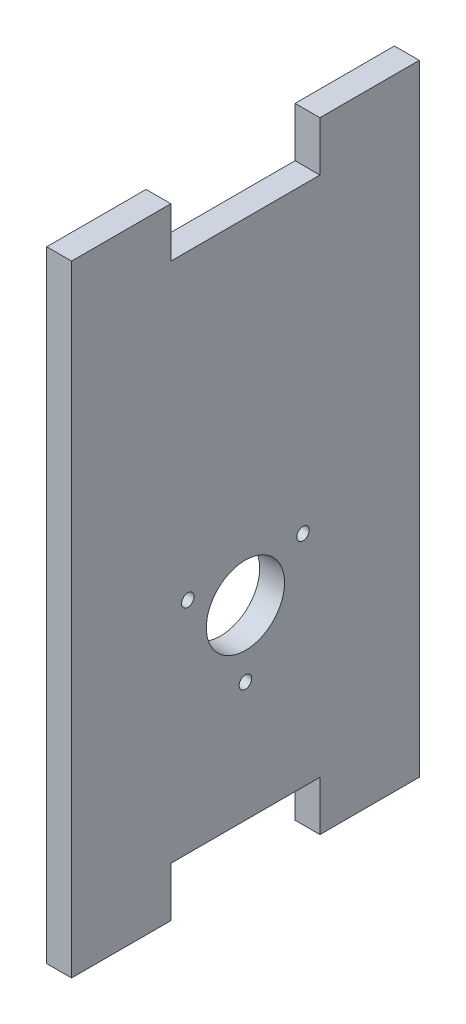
from build123d import *

# Parameters (mm, degrees)
SKETCH1_R      = 5
SKETCH1_R_2    = 0.8
EXTRUDE1_DEPTH = 3.175


with BuildPart() as part:
    # Sketch1 → Extrude1 (new body)
    with BuildSketch(Plane(origin=(0, 0, 0), x_dir=(0, 0, -1), z_dir=(1, 0, 0))):
        Polygon((-9.525, 0), (-9.525, -6.35), (-22.225, -6.35), (-22.225, 73.025), (-9.525, 73.025), (-9.525, 66.675), (9.525, 66.675), (9.525, 73.025), (22.225, 73.025), (22.225, -6.35), (9.525, -6.35), (9.525, 0), align=None)
        with Locations((0, 23.8125)):
            Circle(SKETCH1_R, mode=Mode.SUBTRACT)
        with Locations((0, 15.3125)):
            Circle(SKETCH1_R_2, mode=Mode.SUBTRACT)
        with Locations((-7.361215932, 28.0625)):
            Circle(SKETCH1_R_2, mode=Mode.SUBTRACT)
        with Locations((7.361215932, 28.0625)):
            Circle(SKETCH1_R_2, mode=Mode.SUBTRACT)
    extrude(amount=EXTRUDE1_DEPTH)


solid = part.part
